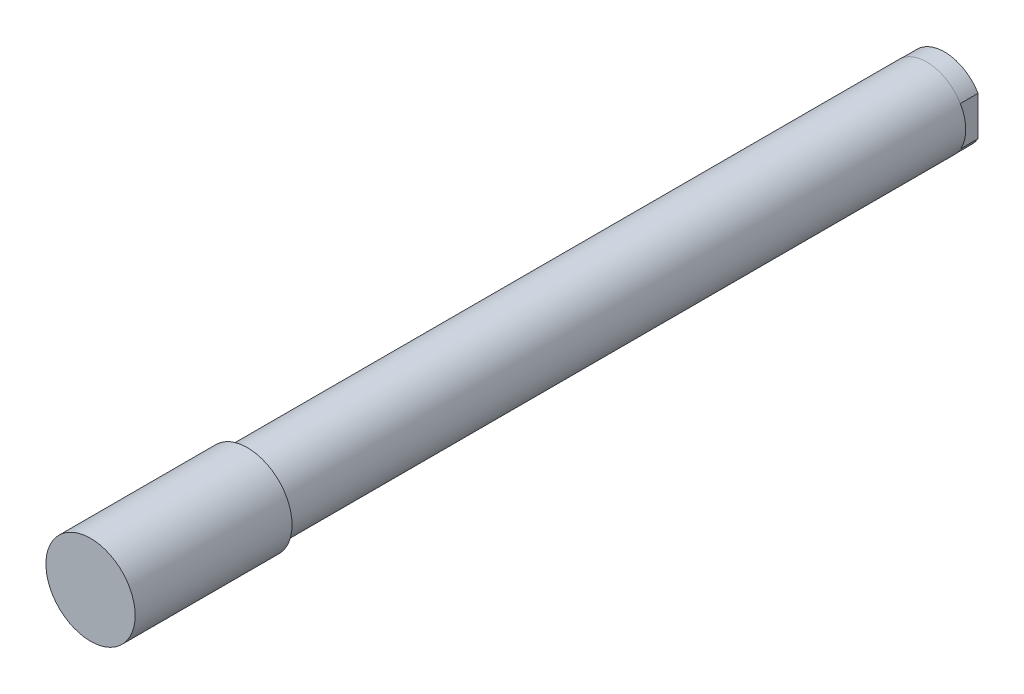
ISO-10303-21;
HEADER;
FILE_DESCRIPTION(('STEP AP214'),'2;1');
FILE_NAME('part.step','',(''),(''),'','','');
FILE_SCHEMA(('AUTOMOTIVE_DESIGN { 1 0 10303 214 1 1 1 1 }'));
ENDSEC;
DATA;
#1=APPLICATION_CONTEXT('core data for automotive mechanical design processes');
#2=APPLICATION_PROTOCOL_DEFINITION('international standard','automotive_design',2000,#1);
#3=PRODUCT_CONTEXT('',#1,'mechanical');
#4=PRODUCT('Part','Part','',(#3));
#5=PRODUCT_RELATED_PRODUCT_CATEGORY('part','',(#4));
#6=PRODUCT_DEFINITION_FORMATION('','',#4);
#7=PRODUCT_DEFINITION_CONTEXT('part definition',#1,'design');
#8=PRODUCT_DEFINITION('design','',#6,#7);
#9=PRODUCT_DEFINITION_SHAPE('','',#8);
#10=(LENGTH_UNIT() NAMED_UNIT(*) SI_UNIT(.MILLI.,.METRE.));
#11=(NAMED_UNIT(*) PLANE_ANGLE_UNIT() SI_UNIT($,.RADIAN.));
#12=(NAMED_UNIT(*) SI_UNIT($,.STERADIAN.) SOLID_ANGLE_UNIT());
#13=UNCERTAINTY_MEASURE_WITH_UNIT(LENGTH_MEASURE(1.E-05),#10,'distance_accuracy_value','');
#14=(GEOMETRIC_REPRESENTATION_CONTEXT(3) GLOBAL_UNCERTAINTY_ASSIGNED_CONTEXT((#13)) GLOBAL_UNIT_ASSIGNED_CONTEXT((#10,
#11,#12)) REPRESENTATION_CONTEXT('',''));
#15=CARTESIAN_POINT('',(0.,0.,0.));
#16=DIRECTION('',(0.,0.,1.));
#17=DIRECTION('',(1.,0.,0.));
#18=AXIS2_PLACEMENT_3D('',#15,#16,#17);
#19=CARTESIAN_POINT('',(0.,0.,10.16));
#20=DIRECTION('',(0.,0.,-1.));
#21=DIRECTION('',(0.,1.,0.));
#22=AXIS2_PLACEMENT_3D('',#19,#20,#21);
#23=CYLINDRICAL_SURFACE('',#22,22.098);
#24=DIRECTION('',(0.,0.,-1.));
#25=VECTOR('',#24,1.);
#26=CARTESIAN_POINT('',(-19.05,-11.1990671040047,32.7645729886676));
#27=LINE('',#26,#25);
#28=CARTESIAN_POINT('',(-19.05,-11.1990671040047,10.16));
#29=VERTEX_POINT('',#28);
#30=CARTESIAN_POINT('',(-19.05,-11.1990671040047,0.));
#31=VERTEX_POINT('',#30);
#32=EDGE_CURVE('E72',#29,#31,#27,.T.);
#33=ORIENTED_EDGE('',*,*,#32,.T.);
#34=CARTESIAN_POINT('',(0.,0.,0.));
#35=DIRECTION('',(0.,0.,-1.));
#36=DIRECTION('',(0.,1.,0.));
#37=AXIS2_PLACEMENT_3D('',#34,#35,#36);
#38=CIRCLE('',#37,22.098);
#39=CARTESIAN_POINT('',(19.05,-11.1990671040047,0.));
#40=VERTEX_POINT('',#39);
#41=EDGE_CURVE('E22',#40,#31,#38,.T.);
#42=ORIENTED_EDGE('',*,*,#41,.F.);
#43=DIRECTION('',(0.,0.,-1.));
#44=VECTOR('',#43,1.);
#45=CARTESIAN_POINT('',(19.05,-11.1990671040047,32.7645729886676));
#46=LINE('',#45,#44);
#47=CARTESIAN_POINT('',(19.05,-11.1990671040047,10.16));
#48=VERTEX_POINT('',#47);
#49=EDGE_CURVE('E52',#48,#40,#46,.T.);
#50=ORIENTED_EDGE('',*,*,#49,.F.);
#51=CARTESIAN_POINT('',(0.,0.,10.16));
#52=DIRECTION('',(0.,0.,-1.));
#53=DIRECTION('',(-1.,0.,0.));
#54=AXIS2_PLACEMENT_3D('',#51,#52,#53);
#55=CIRCLE('',#54,22.098);
#56=EDGE_CURVE('E28',#48,#29,#55,.T.);
#57=ORIENTED_EDGE('',*,*,#56,.T.);
#58=EDGE_LOOP('',(#33,#42,#50,#57));
#59=FACE_BOUND('',#58,.T.);
#60=ADVANCED_FACE('F18',(#59),#23,.T.);
#61=CARTESIAN_POINT('',(0.,0.,0.));
#62=DIRECTION('',(0.,0.,-1.));
#63=DIRECTION('',(0.,1.,0.));
#64=AXIS2_PLACEMENT_3D('',#61,#62,#63);
#65=PLANE('',#64);
#66=DIRECTION('',(0.,-1.,0.));
#67=VECTOR('',#66,1.);
#68=CARTESIAN_POINT('',(-19.05,-11.1990671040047,0.));
#69=LINE('',#68,#67);
#70=CARTESIAN_POINT('',(-19.05,11.1990671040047,0.));
#71=VERTEX_POINT('',#70);
#72=EDGE_CURVE('E76',#71,#31,#69,.T.);
#73=ORIENTED_EDGE('',*,*,#72,.F.);
#74=CARTESIAN_POINT('',(19.05,11.1990671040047,0.));
#75=VERTEX_POINT('',#74);
#76=EDGE_CURVE('E88',#71,#75,#38,.T.);
#77=ORIENTED_EDGE('',*,*,#76,.T.);
#78=DIRECTION('',(0.,1.,0.));
#79=VECTOR('',#78,1.);
#80=CARTESIAN_POINT('',(19.05,-11.1990671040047,0.));
#81=LINE('',#80,#79);
#82=EDGE_CURVE('E77',#40,#75,#81,.T.);
#83=ORIENTED_EDGE('',*,*,#82,.F.);
#84=ORIENTED_EDGE('',*,*,#41,.T.);
#85=EDGE_LOOP('',(#73,#77,#83,#84));
#86=FACE_BOUND('',#85,.T.);
#87=CARTESIAN_POINT('',(0.,0.,0.));
#88=DIRECTION('',(0.,0.,-1.));
#89=DIRECTION('',(0.,1.,0.));
#90=AXIS2_PLACEMENT_3D('',#87,#88,#89);
#91=CIRCLE('',#90,9.25);
#92=CARTESIAN_POINT('',(0.,9.25,0.));
#93=VERTEX_POINT('',#92);
#94=EDGE_CURVE('E86',#93,#93,#91,.T.);
#95=ORIENTED_EDGE('',*,*,#94,.F.);
#96=EDGE_LOOP('',(#95));
#97=FACE_BOUND('',#96,.T.);
#98=ADVANCED_FACE('F113',(#86,#97),#65,.T.);
#99=CARTESIAN_POINT('',(0.,0.,0.));
#100=DIRECTION('',(0.,0.,-1.));
#101=DIRECTION('',(0.,1.,0.));
#102=AXIS2_PLACEMENT_3D('',#99,#100,#101);
#103=CYLINDRICAL_SURFACE('',#102,9.25);
#104=CARTESIAN_POINT('',(0.,0.,35.0012));
#105=DIRECTION('',(0.,0.,-1.));
#106=DIRECTION('',(-1.,0.,0.));
#107=AXIS2_PLACEMENT_3D('',#104,#105,#106);
#108=CIRCLE('',#107,9.25);
#109=CARTESIAN_POINT('',(-9.24999999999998,0.,35.0012));
#110=VERTEX_POINT('',#109);
#111=EDGE_CURVE('E67',#110,#110,#108,.T.);
#112=ORIENTED_EDGE('',*,*,#111,.F.);
#113=EDGE_LOOP('',(#112));
#114=FACE_BOUND('',#113,.T.);
#115=ORIENTED_EDGE('',*,*,#94,.T.);
#116=EDGE_LOOP('',(#115));
#117=FACE_BOUND('',#116,.T.);
#118=ADVANCED_FACE('F116',(#114,#117),#103,.F.);
#119=DIRECTION('',(0.,0.,-1.));
#120=VECTOR('',#119,1.);
#121=CARTESIAN_POINT('',(-19.05,11.1990671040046,32.7645729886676));
#122=LINE('',#121,#120);
#123=CARTESIAN_POINT('',(-19.05,11.1990671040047,10.16));
#124=VERTEX_POINT('',#123);
#125=EDGE_CURVE('E59',#124,#71,#122,.T.);
#126=ORIENTED_EDGE('',*,*,#125,.F.);
#127=CARTESIAN_POINT('',(0.,0.,10.16));
#128=DIRECTION('',(0.,0.,-1.));
#129=DIRECTION('',(-1.,0.,0.));
#130=AXIS2_PLACEMENT_3D('',#127,#128,#129);
#131=CIRCLE('',#130,22.098);
#132=CARTESIAN_POINT('',(19.05,11.1990671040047,10.16));
#133=VERTEX_POINT('',#132);
#134=EDGE_CURVE('E63',#124,#133,#131,.T.);
#135=ORIENTED_EDGE('',*,*,#134,.T.);
#136=DIRECTION('',(0.,0.,-1.));
#137=VECTOR('',#136,1.);
#138=CARTESIAN_POINT('',(19.05,11.1990671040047,32.7645729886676));
#139=LINE('',#138,#137);
#140=EDGE_CURVE('E83',#133,#75,#139,.T.);
#141=ORIENTED_EDGE('',*,*,#140,.T.);
#142=ORIENTED_EDGE('',*,*,#76,.F.);
#143=EDGE_LOOP('',(#126,#135,#141,#142));
#144=FACE_BOUND('',#143,.T.);
#145=ADVANCED_FACE('F20',(#144),#23,.T.);
#146=CARTESIAN_POINT('',(-19.05,-11.1990671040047,32.7645729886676));
#147=DIRECTION('',(1.,0.,0.));
#148=DIRECTION('',(0.,0.,-1.));
#149=AXIS2_PLACEMENT_3D('',#146,#147,#148);
#150=PLANE('',#149);
#151=DIRECTION('',(0.,-1.,0.));
#152=VECTOR('',#151,1.);
#153=CARTESIAN_POINT('',(-19.05,0.,10.16));
#154=LINE('',#153,#152);
#155=EDGE_CURVE('E64',#124,#29,#154,.T.);
#156=ORIENTED_EDGE('',*,*,#155,.F.);
#157=ORIENTED_EDGE('',*,*,#125,.T.);
#158=ORIENTED_EDGE('',*,*,#72,.T.);
#159=ORIENTED_EDGE('',*,*,#32,.F.);
#160=EDGE_LOOP('',(#156,#157,#158,#159));
#161=FACE_BOUND('',#160,.T.);
#162=ADVANCED_FACE('F75',(#161),#150,.F.);
#163=CARTESIAN_POINT('',(19.05,-11.1990671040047,32.7645729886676));
#164=DIRECTION('',(-1.,0.,0.));
#165=DIRECTION('',(0.,1.,0.));
#166=AXIS2_PLACEMENT_3D('',#163,#164,#165);
#167=PLANE('',#166);
#168=DIRECTION('',(0.,1.,0.));
#169=VECTOR('',#168,1.);
#170=CARTESIAN_POINT('',(19.05,0.,10.16));
#171=LINE('',#170,#169);
#172=EDGE_CURVE('E11',#48,#133,#171,.T.);
#173=ORIENTED_EDGE('',*,*,#172,.F.);
#174=ORIENTED_EDGE('',*,*,#49,.T.);
#175=ORIENTED_EDGE('',*,*,#82,.T.);
#176=ORIENTED_EDGE('',*,*,#140,.F.);
#177=EDGE_LOOP('',(#173,#174,#175,#176));
#178=FACE_BOUND('',#177,.T.);
#179=ADVANCED_FACE('F112',(#178),#167,.F.);
#180=CARTESIAN_POINT('',(0.,0.,35.0012));
#181=DIRECTION('',(0.,0.,-1.));
#182=DIRECTION('',(-1.,0.,0.));
#183=AXIS2_PLACEMENT_3D('',#180,#181,#182);
#184=PLANE('',#183);
#185=ORIENTED_EDGE('',*,*,#111,.T.);
#186=EDGE_LOOP('',(#185));
#187=FACE_BOUND('',#186,.T.);
#188=ADVANCED_FACE('F127',(#187),#184,.T.);
#189=CARTESIAN_POINT('',(2.02448469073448E-13,-1.51966790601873E-13,486.2068));
#190=DIRECTION('',(0.,0.,1.));
#191=DIRECTION('',(1.,0.,0.));
#192=AXIS2_PLACEMENT_3D('',#189,#190,#191);
#193=PLANE('',#192);
#194=CARTESIAN_POINT('',(2.02448469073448E-13,-1.51966790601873E-13,486.2068));
#195=DIRECTION('',(0.,0.,1.));
#196=DIRECTION('',(1.,0.,0.));
#197=AXIS2_PLACEMENT_3D('',#194,#195,#196);
#198=CIRCLE('',#197,25.4);
#199=CARTESIAN_POINT('',(25.4000000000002,-1.59016706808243E-13,486.2068));
#200=VERTEX_POINT('',#199);
#201=EDGE_CURVE('E95',#200,#200,#198,.T.);
#202=ORIENTED_EDGE('',*,*,#201,.T.);
#203=EDGE_LOOP('',(#202));
#204=FACE_BOUND('',#203,.T.);
#205=ADVANCED_FACE('F125',(#204),#193,.T.);
#206=CARTESIAN_POINT('',(2.02448469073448E-13,-1.51966790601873E-13,486.2068));
#207=DIRECTION('',(0.,0.,-1.));
#208=DIRECTION('',(-1.,0.,0.));
#209=AXIS2_PLACEMENT_3D('',#206,#207,#208);
#210=CYLINDRICAL_SURFACE('',#209,25.4);
#211=ORIENTED_EDGE('',*,*,#201,.F.);
#212=EDGE_LOOP('',(#211));
#213=FACE_BOUND('',#212,.T.);
#214=CARTESIAN_POINT('',(1.65458898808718E-13,-1.2486949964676E-13,396.875));
#215=DIRECTION('',(0.,0.,1.));
#216=DIRECTION('',(1.,0.,0.));
#217=AXIS2_PLACEMENT_3D('',#214,#215,#216);
#218=CIRCLE('',#217,25.4);
#219=CARTESIAN_POINT('',(25.4000000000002,-1.31919415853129E-13,396.875));
#220=VERTEX_POINT('',#219);
#221=EDGE_CURVE('E93',#220,#220,#218,.T.);
#222=ORIENTED_EDGE('',*,*,#221,.T.);
#223=EDGE_LOOP('',(#222));
#224=FACE_BOUND('',#223,.T.);
#225=ADVANCED_FACE('F136',(#213,#224),#210,.T.);
#226=CARTESIAN_POINT('',(1.65458898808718E-13,-1.2486949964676E-13,396.875));
#227=DIRECTION('',(0.,0.,1.));
#228=DIRECTION('',(1.,0.,0.));
#229=AXIS2_PLACEMENT_3D('',#226,#227,#228);
#230=PLANE('',#229);
#231=CARTESIAN_POINT('',(1.65458898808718E-13,-1.2486949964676E-13,396.875));
#232=DIRECTION('',(0.,0.,1.));
#233=DIRECTION('',(1.,0.,0.));
#234=AXIS2_PLACEMENT_3D('',#231,#232,#233);
#235=CIRCLE('',#234,22.225);
#236=CARTESIAN_POINT('',(22.2250000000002,-1.31038176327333E-13,396.875));
#237=VERTEX_POINT('',#236);
#238=EDGE_CURVE('E100',#237,#237,#235,.T.);
#239=ORIENTED_EDGE('',*,*,#238,.T.);
#240=EDGE_LOOP('',(#239));
#241=FACE_BOUND('',#240,.T.);
#242=ORIENTED_EDGE('',*,*,#221,.F.);
#243=EDGE_LOOP('',(#242));
#244=FACE_BOUND('',#243,.T.);
#245=ADVANCED_FACE('F150',(#241,#244),#230,.F.);
#246=CARTESIAN_POINT('',(0.,0.,10.16));
#247=DIRECTION('',(0.,0.,1.));
#248=DIRECTION('',(1.,0.,0.));
#249=AXIS2_PLACEMENT_3D('',#246,#247,#248);
#250=CYLINDRICAL_SURFACE('',#249,22.225);
#251=CARTESIAN_POINT('',(0.,0.,10.16));
#252=DIRECTION('',(0.,0.,-1.));
#253=DIRECTION('',(-1.,0.,0.));
#254=AXIS2_PLACEMENT_3D('',#251,#252,#253);
#255=CIRCLE('',#254,22.225);
#256=CARTESIAN_POINT('',(-22.225,0.,10.16));
#257=VERTEX_POINT('',#256);
#258=EDGE_CURVE('E105',#257,#257,#255,.T.);
#259=ORIENTED_EDGE('',*,*,#258,.F.);
#260=EDGE_LOOP('',(#259));
#261=FACE_BOUND('',#260,.T.);
#262=ORIENTED_EDGE('',*,*,#238,.F.);
#263=EDGE_LOOP('',(#262));
#264=FACE_BOUND('',#263,.T.);
#265=ADVANCED_FACE('F148',(#261,#264),#250,.T.);
#266=CARTESIAN_POINT('',(0.,0.,10.16));
#267=DIRECTION('',(0.,0.,-1.));
#268=DIRECTION('',(-1.,0.,0.));
#269=AXIS2_PLACEMENT_3D('',#266,#267,#268);
#270=PLANE('',#269);
#271=ORIENTED_EDGE('',*,*,#258,.T.);
#272=EDGE_LOOP('',(#271));
#273=FACE_BOUND('',#272,.T.);
#274=ORIENTED_EDGE('',*,*,#56,.F.);
#275=ORIENTED_EDGE('',*,*,#172,.T.);
#276=ORIENTED_EDGE('',*,*,#134,.F.);
#277=ORIENTED_EDGE('',*,*,#155,.T.);
#278=EDGE_LOOP('',(#274,#275,#276,#277));
#279=FACE_BOUND('',#278,.T.);
#280=ADVANCED_FACE('F65',(#273,#279),#270,.T.);
#281=CLOSED_SHELL('',(#60,#98,#118,#145,#162,#179,#188,#205,#225,#245,#265,#280));
#282=MANIFOLD_SOLID_BREP('B1',#281);
#283=ADVANCED_BREP_SHAPE_REPRESENTATION('',(#18,#282),#14);
#284=SHAPE_DEFINITION_REPRESENTATION(#9,#283);
ENDSEC;
END-ISO-10303-21;
